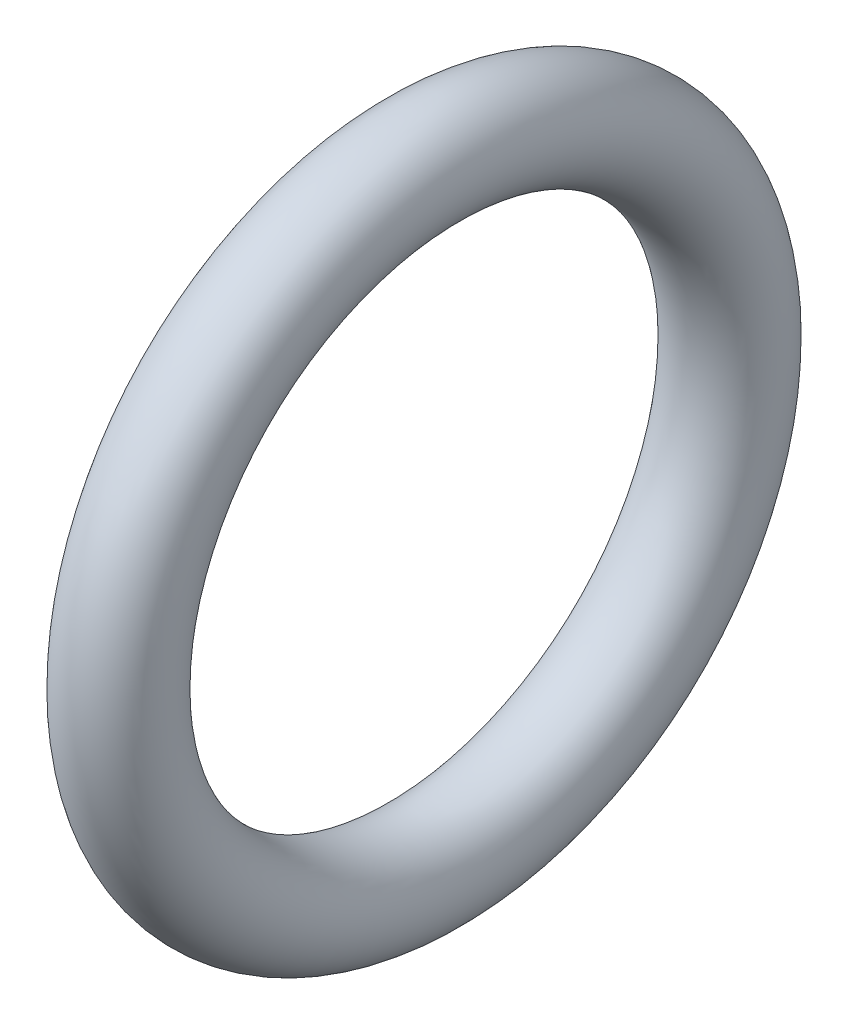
ISO-10303-21;
HEADER;
FILE_DESCRIPTION(('STEP AP214'),'2;1');
FILE_NAME('part.step','',(''),(''),'','','');
FILE_SCHEMA(('AUTOMOTIVE_DESIGN { 1 0 10303 214 1 1 1 1 }'));
ENDSEC;
DATA;
#1=APPLICATION_CONTEXT('core data for automotive mechanical design processes');
#2=APPLICATION_PROTOCOL_DEFINITION('international standard','automotive_design',2000,#1);
#3=PRODUCT_CONTEXT('',#1,'mechanical');
#4=PRODUCT('Part','Part','',(#3));
#5=PRODUCT_RELATED_PRODUCT_CATEGORY('part','',(#4));
#6=PRODUCT_DEFINITION_FORMATION('','',#4);
#7=PRODUCT_DEFINITION_CONTEXT('part definition',#1,'design');
#8=PRODUCT_DEFINITION('design','',#6,#7);
#9=PRODUCT_DEFINITION_SHAPE('','',#8);
#10=(LENGTH_UNIT() NAMED_UNIT(*) SI_UNIT(.MILLI.,.METRE.));
#11=(NAMED_UNIT(*) PLANE_ANGLE_UNIT() SI_UNIT($,.RADIAN.));
#12=(NAMED_UNIT(*) SI_UNIT($,.STERADIAN.) SOLID_ANGLE_UNIT());
#13=UNCERTAINTY_MEASURE_WITH_UNIT(LENGTH_MEASURE(1.E-05),#10,'distance_accuracy_value','');
#14=(GEOMETRIC_REPRESENTATION_CONTEXT(3) GLOBAL_UNCERTAINTY_ASSIGNED_CONTEXT((#13)) GLOBAL_UNIT_ASSIGNED_CONTEXT((#10,
#11,#12)) REPRESENTATION_CONTEXT('',''));
#15=CARTESIAN_POINT('',(0.,0.,0.));
#16=DIRECTION('',(0.,0.,1.));
#17=DIRECTION('',(1.,0.,0.));
#18=AXIS2_PLACEMENT_3D('',#15,#16,#17);
#19=CARTESIAN_POINT('',(0.,0.,0.));
#20=DIRECTION('',(-1.,0.,0.));
#21=DIRECTION('',(0.,0.,1.));
#22=AXIS2_PLACEMENT_3D('',#19,#20,#21);
#23=TOROIDAL_SURFACE('',#22,8.15,1.35);
#24=CARTESIAN_POINT('',(0.,0.,9.5));
#25=VERTEX_POINT('',#24);
#26=VERTEX_LOOP('',#25);
#27=FACE_BOUND('',#26,.T.);
#28=ADVANCED_FACE('F20',(#27),#23,.T.);
#29=CLOSED_SHELL('',(#28));
#30=MANIFOLD_SOLID_BREP('B2',#29);
#31=ADVANCED_BREP_SHAPE_REPRESENTATION('',(#18,#30),#14);
#32=SHAPE_DEFINITION_REPRESENTATION(#9,#31);
ENDSEC;
END-ISO-10303-21;
